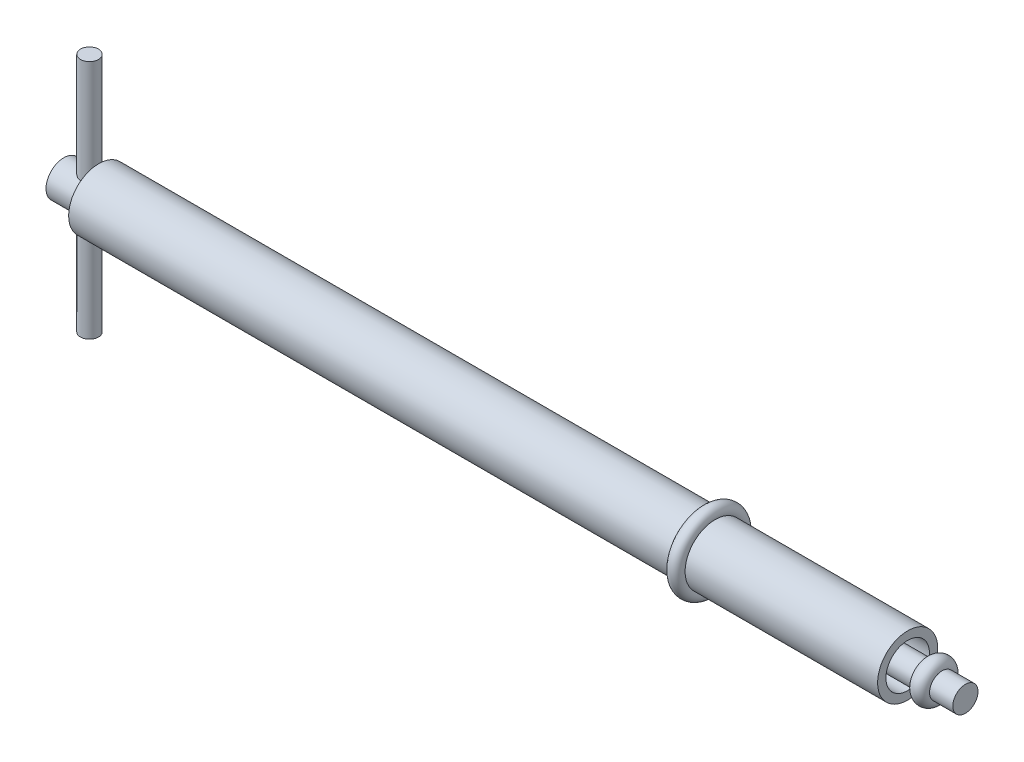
ISO-10303-21;
HEADER;
FILE_DESCRIPTION(('STEP AP214'),'2;1');
FILE_NAME('part.step','',(''),(''),'','','');
FILE_SCHEMA(('AUTOMOTIVE_DESIGN { 1 0 10303 214 1 1 1 1 }'));
ENDSEC;
DATA;
#1=APPLICATION_CONTEXT('core data for automotive mechanical design processes');
#2=APPLICATION_PROTOCOL_DEFINITION('international standard','automotive_design',2000,#1);
#3=PRODUCT_CONTEXT('',#1,'mechanical');
#4=PRODUCT('Part','Part','',(#3));
#5=PRODUCT_RELATED_PRODUCT_CATEGORY('part','',(#4));
#6=PRODUCT_DEFINITION_FORMATION('','',#4);
#7=PRODUCT_DEFINITION_CONTEXT('part definition',#1,'design');
#8=PRODUCT_DEFINITION('design','',#6,#7);
#9=PRODUCT_DEFINITION_SHAPE('','',#8);
#10=(LENGTH_UNIT() NAMED_UNIT(*) SI_UNIT(.MILLI.,.METRE.));
#11=(NAMED_UNIT(*) PLANE_ANGLE_UNIT() SI_UNIT($,.RADIAN.));
#12=(NAMED_UNIT(*) SI_UNIT($,.STERADIAN.) SOLID_ANGLE_UNIT());
#13=UNCERTAINTY_MEASURE_WITH_UNIT(LENGTH_MEASURE(1.E-05),#10,'distance_accuracy_value','');
#14=(GEOMETRIC_REPRESENTATION_CONTEXT(3) GLOBAL_UNCERTAINTY_ASSIGNED_CONTEXT((#13)) GLOBAL_UNIT_ASSIGNED_CONTEXT((#10,
#11,#12)) REPRESENTATION_CONTEXT('',''));
#15=CARTESIAN_POINT('',(0.,0.,0.));
#16=DIRECTION('',(0.,0.,1.));
#17=DIRECTION('',(1.,0.,0.));
#18=AXIS2_PLACEMENT_3D('',#15,#16,#17);
#19=CARTESIAN_POINT('',(0.,0.,0.));
#20=DIRECTION('',(1.,0.,0.));
#21=DIRECTION('',(0.,0.,-1.));
#22=AXIS2_PLACEMENT_3D('',#19,#20,#21);
#23=PLANE('',#22);
#24=CARTESIAN_POINT('',(0.,0.,0.));
#25=DIRECTION('',(-1.,0.,0.));
#26=DIRECTION('',(0.,0.,1.));
#27=AXIS2_PLACEMENT_3D('',#24,#25,#26);
#28=CIRCLE('',#27,2.96848884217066);
#29=CARTESIAN_POINT('',(0.,0.,2.96848884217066));
#30=VERTEX_POINT('',#29);
#31=EDGE_CURVE('E9',#30,#30,#28,.T.);
#32=ORIENTED_EDGE('',*,*,#31,.T.);
#33=EDGE_LOOP('',(#32));
#34=FACE_BOUND('',#33,.T.);
#35=ADVANCED_FACE('F14',(#34),#23,.F.);
#36=CARTESIAN_POINT('',(0.,0.,0.));
#37=DIRECTION('',(-1.,0.,0.));
#38=DIRECTION('',(0.,0.,1.));
#39=AXIS2_PLACEMENT_3D('',#36,#37,#38);
#40=CYLINDRICAL_SURFACE('',#39,2.96848884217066);
#41=CARTESIAN_POINT('',(4.2661907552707,-2.56162565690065,1.5));
#42=CARTESIAN_POINT('',(4.34422264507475,-2.56163267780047,1.4999944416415));
#43=CARTESIAN_POINT('',(4.42235011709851,-2.5652455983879,1.49387019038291));
#44=CARTESIAN_POINT('',(4.57619660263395,-2.57917019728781,1.46969018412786));
#45=CARTESIAN_POINT('',(4.65191032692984,-2.58949565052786,1.45160989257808));
#46=CARTESIAN_POINT('',(4.7984121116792,-2.61534051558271,1.40450365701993));
#47=CARTESIAN_POINT('',(4.86922439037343,-2.63083180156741,1.37553687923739));
#48=CARTESIAN_POINT('',(5.00496574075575,-2.66521903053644,1.3076607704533));
#49=CARTESIAN_POINT('',(5.06989438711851,-2.68411521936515,1.26875072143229));
#50=CARTESIAN_POINT('',(5.1980701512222,-2.72512943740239,1.17824574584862));
#51=CARTESIAN_POINT('',(5.26071360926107,-2.74738478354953,1.12585775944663));
#52=CARTESIAN_POINT('',(5.37679616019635,-2.79150219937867,1.01153200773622));
#53=CARTESIAN_POINT('',(5.43023057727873,-2.81336406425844,0.949589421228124));
#54=CARTESIAN_POINT('',(5.53000027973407,-2.85604040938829,0.812675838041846));
#55=CARTESIAN_POINT('',(5.57558830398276,-2.87667768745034,0.737099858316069));
#56=CARTESIAN_POINT('',(5.65312694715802,-2.91278858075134,0.57811281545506));
#57=CARTESIAN_POINT('',(5.68508635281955,-2.92826552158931,0.494706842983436));
#58=CARTESIAN_POINT('',(5.73205409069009,-2.95132082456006,0.328826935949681));
#59=CARTESIAN_POINT('',(5.74812234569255,-2.95939000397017,0.246722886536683));
#60=CARTESIAN_POINT('',(5.76634693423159,-2.96855664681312,0.0806187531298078));
#61=CARTESIAN_POINT('',(5.76851189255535,-2.96965843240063,-0.00338012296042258));
#62=CARTESIAN_POINT('',(5.75926674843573,-2.96499461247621,-0.162900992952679));
#63=CARTESIAN_POINT('',(5.74904466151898,-2.95982995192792,-0.238513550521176));
#64=CARTESIAN_POINT('',(5.71744812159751,-2.94412744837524,-0.386779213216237));
#65=CARTESIAN_POINT('',(5.69607283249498,-2.93358920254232,-0.459432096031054));
#66=CARTESIAN_POINT('',(5.64265046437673,-2.90792243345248,-0.600967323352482));
#67=CARTESIAN_POINT('',(5.6104622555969,-2.89273345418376,-0.669784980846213));
#68=CARTESIAN_POINT('',(5.53652935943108,-2.85912624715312,-0.801205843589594));
#69=CARTESIAN_POINT('',(5.49478127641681,-2.84070687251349,-0.863806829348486));
#70=CARTESIAN_POINT('',(5.39831355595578,-2.80027310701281,-0.987431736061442));
#71=CARTESIAN_POINT('',(5.34273339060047,-2.77808334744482,-1.04772730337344));
#72=CARTESIAN_POINT('',(5.22247589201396,-2.73373058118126,-1.15853905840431));
#73=CARTESIAN_POINT('',(5.15779137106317,-2.711567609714,-1.20904744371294));
#74=CARTESIAN_POINT('',(5.01595350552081,-2.66818702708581,-1.30211863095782));
#75=CARTESIAN_POINT('',(4.93825943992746,-2.64712790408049,-1.34393869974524));
#76=CARTESIAN_POINT('',(4.77563373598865,-2.61059724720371,-1.41360191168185));
#77=CARTESIAN_POINT('',(4.69070988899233,-2.59511979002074,-1.44145988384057));
#78=CARTESIAN_POINT('',(4.52314660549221,-2.5732516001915,-1.48012245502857));
#79=CARTESIAN_POINT('',(4.44086504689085,-2.5662346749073,-1.4921098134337));
#80=CARTESIAN_POINT('',(4.27518725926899,-2.56030791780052,-1.50226241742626));
#81=CARTESIAN_POINT('',(4.19179190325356,-2.56139207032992,-1.50043791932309));
#82=CARTESIAN_POINT('',(4.0363004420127,-2.57088003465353,-1.48410429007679));
#83=CARTESIAN_POINT('',(3.96399155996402,-2.57844372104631,-1.47105036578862));
#84=CARTESIAN_POINT('',(3.82273455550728,-2.5987858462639,-1.43480545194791));
#85=CARTESIAN_POINT('',(3.75378756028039,-2.61156602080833,-1.4116110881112));
#86=CARTESIAN_POINT('',(3.61758262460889,-2.64158935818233,-1.35462537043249));
#87=CARTESIAN_POINT('',(3.55054962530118,-2.65901132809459,-1.32039421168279));
#88=CARTESIAN_POINT('',(3.4227891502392,-2.69620279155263,-1.24268708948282));
#89=CARTESIAN_POINT('',(3.36206494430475,-2.71597349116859,-1.19920636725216));
#90=CARTESIAN_POINT('',(3.24042974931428,-2.75870627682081,-1.09766735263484));
#91=CARTESIAN_POINT('',(3.18050972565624,-2.78175048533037,-1.03845113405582));
#92=CARTESIAN_POINT('',(3.07113715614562,-2.82623083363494,-0.910458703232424));
#93=CARTESIAN_POINT('',(3.02168838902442,-2.84766639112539,-0.841679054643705));
#94=CARTESIAN_POINT('',(2.93345142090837,-2.88730330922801,-0.693843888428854));
#95=CARTESIAN_POINT('',(2.89500808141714,-2.90539479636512,-0.61455096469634));
#96=CARTESIAN_POINT('',(2.83239387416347,-2.93546253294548,-0.449446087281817));
#97=CARTESIAN_POINT('',(2.80821021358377,-2.94744426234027,-0.363640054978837));
#98=CARTESIAN_POINT('',(2.77692709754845,-2.96305064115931,-0.196555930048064));
#99=CARTESIAN_POINT('',(2.76844828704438,-2.96734871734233,-0.115598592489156));
#100=CARTESIAN_POINT('',(2.76472481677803,-2.96922900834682,0.046686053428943));
#101=CARTESIAN_POINT('',(2.76947531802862,-2.96681367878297,0.128013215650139));
#102=CARTESIAN_POINT('',(2.79117351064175,-2.95593044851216,0.282881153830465));
#103=CARTESIAN_POINT('',(2.80726716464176,-2.94788661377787,0.356574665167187));
#104=CARTESIAN_POINT('',(2.8500269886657,-2.92696073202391,0.500089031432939));
#105=CARTESIAN_POINT('',(2.87669464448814,-2.91407800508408,0.569909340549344));
#106=CARTESIAN_POINT('',(2.94100554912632,-2.88395591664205,0.70700699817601));
#107=CARTESIAN_POINT('',(2.97906392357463,-2.86655585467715,0.774053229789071));
#108=CARTESIAN_POINT('',(3.06455784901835,-2.82919949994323,0.901081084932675));
#109=CARTESIAN_POINT('',(3.11199768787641,-2.80924203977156,0.961059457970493));
#110=CARTESIAN_POINT('',(3.2204757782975,-2.76635443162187,1.0786621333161));
#111=CARTESIAN_POINT('',(3.28240495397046,-2.74332800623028,1.13543169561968));
#112=CARTESIAN_POINT('',(3.41521608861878,-2.69855126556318,1.23810027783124));
#113=CARTESIAN_POINT('',(3.48610617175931,-2.67680213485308,1.28398932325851));
#114=CARTESIAN_POINT('',(3.63807370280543,-2.63645767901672,1.36496837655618));
#115=CARTESIAN_POINT('',(3.71942032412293,-2.61799889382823,1.39962566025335));
#116=CARTESIAN_POINT('',(3.88798624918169,-2.5880823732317,1.45421765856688));
#117=CARTESIAN_POINT('',(3.97518486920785,-2.57660128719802,1.47420152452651));
#118=CARTESIAN_POINT('',(4.09717142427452,-2.56697512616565,1.49083314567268));
#119=CARTESIAN_POINT('',(4.13084530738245,-2.56497652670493,1.49426512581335));
#120=CARTESIAN_POINT('',(4.1984036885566,-2.56230022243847,1.49884983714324));
#121=CARTESIAN_POINT('',(4.23228820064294,-2.56162260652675,1.50000241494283));
#122=CARTESIAN_POINT('',(4.2661907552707,-2.56162565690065,1.5));
#123=B_SPLINE_CURVE_WITH_KNOTS('',3,(#41,#42,#43,#44,#45,#46,#47,#48,#49,#50,#51,#52,#53,#54,
#55,#56,#57,#58,#59,#60,#61,#62,#63,#64,#65,#66,#67,#68,#69,#70,#71,#72,#73,#74,#75,#76,#77,#78,
#79,#80,#81,#82,#83,#84,#85,#86,#87,#88,#89,#90,#91,#92,#93,#94,#95,#96,#97,#98,#99,#100,#101,
#102,#103,#104,#105,#106,#107,#108,#109,#110,#111,#112,#113,#114,#115,#116,#117,#118,#119,#120,
#121,#122),.UNSPECIFIED.,.T.,.F.,(4,2,2,2,2,2,2,2,2,2,2,2,2,2,2,2,2,2,2,2,2,2,2,2,2,2,2,2,2,2,2,
2,2,2,2,2,2,2,2,2,4),(0.,0.233952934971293,0.468387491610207,0.701565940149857,
0.934761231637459,1.18762397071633,1.44061472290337,1.71111458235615,1.98143977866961,
2.2321892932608,2.48278324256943,2.71113163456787,2.93949714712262,3.17096723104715,
3.40251966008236,3.65630154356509,3.91028491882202,4.18100181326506,4.45143056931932,
4.70029410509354,4.94897285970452,5.16957851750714,5.39025763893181,5.62112511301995,
5.85211165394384,6.11296325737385,6.37390883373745,6.64230820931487,6.91046642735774,
7.15369256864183,7.39682975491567,7.62338321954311,7.84996852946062,8.08610136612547,
8.32234237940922,8.58252752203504,8.8429502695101,9.1124607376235,9.38106425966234,
9.48270307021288,9.58434872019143),.UNSPECIFIED.);
#124=CARTESIAN_POINT('',(4.2661907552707,-2.56162565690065,1.5));
#125=VERTEX_POINT('',#124);
#126=EDGE_CURVE('E17',#125,#125,#123,.T.);
#127=ORIENTED_EDGE('',*,*,#126,.T.);
#128=EDGE_LOOP('',(#127));
#129=FACE_BOUND('',#128,.T.);
#130=CARTESIAN_POINT('',(4.2661907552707,2.56162565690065,1.5));
#131=CARTESIAN_POINT('',(4.18815886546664,2.56163267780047,1.4999944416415));
#132=CARTESIAN_POINT('',(4.11003139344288,2.5652455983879,1.49387019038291));
#133=CARTESIAN_POINT('',(3.95618490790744,2.57917019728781,1.46969018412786));
#134=CARTESIAN_POINT('',(3.88047118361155,2.58949565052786,1.45160989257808));
#135=CARTESIAN_POINT('',(3.73396939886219,2.61534051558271,1.40450365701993));
#136=CARTESIAN_POINT('',(3.66315712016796,2.63083180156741,1.37553687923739));
#137=CARTESIAN_POINT('',(3.52741576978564,2.66521903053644,1.3076607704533));
#138=CARTESIAN_POINT('',(3.46248712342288,2.68411521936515,1.26875072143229));
#139=CARTESIAN_POINT('',(3.33431135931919,2.72512943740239,1.17824574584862));
#140=CARTESIAN_POINT('',(3.27166790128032,2.74738478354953,1.12585775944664));
#141=CARTESIAN_POINT('',(3.15558535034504,2.79150219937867,1.01153200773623));
#142=CARTESIAN_POINT('',(3.10215093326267,2.81336406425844,0.949589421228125));
#143=CARTESIAN_POINT('',(3.00238123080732,2.85604040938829,0.812675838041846));
#144=CARTESIAN_POINT('',(2.95679320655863,2.87667768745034,0.73709985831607));
#145=CARTESIAN_POINT('',(2.87925456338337,2.91278858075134,0.578112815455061));
#146=CARTESIAN_POINT('',(2.84729515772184,2.92826552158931,0.494706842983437));
#147=CARTESIAN_POINT('',(2.8003274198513,2.95132082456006,0.328826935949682));
#148=CARTESIAN_POINT('',(2.78425916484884,2.95939000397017,0.246722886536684));
#149=CARTESIAN_POINT('',(2.7660345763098,2.96855664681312,0.0806187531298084));
#150=CARTESIAN_POINT('',(2.76386961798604,2.96965843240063,-0.00338012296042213));
#151=CARTESIAN_POINT('',(2.77311476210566,2.96499461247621,-0.162900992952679));
#152=CARTESIAN_POINT('',(2.78333684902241,2.95982995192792,-0.238513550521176));
#153=CARTESIAN_POINT('',(2.81493338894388,2.94412744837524,-0.386779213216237));
#154=CARTESIAN_POINT('',(2.83630867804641,2.93358920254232,-0.459432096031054));
#155=CARTESIAN_POINT('',(2.88973104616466,2.90792243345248,-0.600967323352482));
#156=CARTESIAN_POINT('',(2.92191925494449,2.89273345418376,-0.669784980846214));
#157=CARTESIAN_POINT('',(2.99585215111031,2.85912624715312,-0.801205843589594));
#158=CARTESIAN_POINT('',(3.03760023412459,2.84070687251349,-0.863806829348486));
#159=CARTESIAN_POINT('',(3.13406795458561,2.80027310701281,-0.987431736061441));
#160=CARTESIAN_POINT('',(3.18964811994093,2.77808334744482,-1.04772730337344));
#161=CARTESIAN_POINT('',(3.30990561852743,2.73373058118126,-1.15853905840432));
#162=CARTESIAN_POINT('',(3.37459013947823,2.711567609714,-1.20904744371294));
#163=CARTESIAN_POINT('',(3.51642800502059,2.66818702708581,-1.30211863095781));
#164=CARTESIAN_POINT('',(3.59412207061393,2.64712790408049,-1.34393869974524));
#165=CARTESIAN_POINT('',(3.75674777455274,2.6105972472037,-1.41360191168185));
#166=CARTESIAN_POINT('',(3.84167162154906,2.59511979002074,-1.44145988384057));
#167=CARTESIAN_POINT('',(4.00923490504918,2.5732516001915,-1.48012245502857));
#168=CARTESIAN_POINT('',(4.09151646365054,2.5662346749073,-1.4921098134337));
#169=CARTESIAN_POINT('',(4.2571942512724,2.56030791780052,-1.50226241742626));
#170=CARTESIAN_POINT('',(4.34058960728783,2.56139207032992,-1.50043791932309));
#171=CARTESIAN_POINT('',(4.49608106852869,2.57088003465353,-1.48410429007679));
#172=CARTESIAN_POINT('',(4.56838995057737,2.57844372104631,-1.47105036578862));
#173=CARTESIAN_POINT('',(4.70964695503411,2.59878584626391,-1.43480545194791));
#174=CARTESIAN_POINT('',(4.77859395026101,2.61156602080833,-1.4116110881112));
#175=CARTESIAN_POINT('',(4.9147988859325,2.64158935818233,-1.35462537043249));
#176=CARTESIAN_POINT('',(4.98183188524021,2.65901132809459,-1.32039421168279));
#177=CARTESIAN_POINT('',(5.10959236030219,2.69620279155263,-1.24268708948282));
#178=CARTESIAN_POINT('',(5.17031656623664,2.71597349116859,-1.19920636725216));
#179=CARTESIAN_POINT('',(5.29195176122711,2.75870627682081,-1.09766735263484));
#180=CARTESIAN_POINT('',(5.35187178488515,2.78175048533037,-1.03845113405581));
#181=CARTESIAN_POINT('',(5.46124435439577,2.82623083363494,-0.910458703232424));
#182=CARTESIAN_POINT('',(5.51069312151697,2.84766639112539,-0.841679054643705));
#183=CARTESIAN_POINT('',(5.59893008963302,2.88730330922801,-0.693843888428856));
#184=CARTESIAN_POINT('',(5.63737342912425,2.90539479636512,-0.614550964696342));
#185=CARTESIAN_POINT('',(5.69998763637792,2.93546253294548,-0.449446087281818));
#186=CARTESIAN_POINT('',(5.72417129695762,2.94744426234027,-0.363640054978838));
#187=CARTESIAN_POINT('',(5.75545441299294,2.96305064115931,-0.196555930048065));
#188=CARTESIAN_POINT('',(5.76393322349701,2.96734871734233,-0.115598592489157));
#189=CARTESIAN_POINT('',(5.76765669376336,2.96922900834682,0.0466860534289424));
#190=CARTESIAN_POINT('',(5.76290619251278,2.96681367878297,0.128013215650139));
#191=CARTESIAN_POINT('',(5.74120799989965,2.95593044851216,0.282881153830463));
#192=CARTESIAN_POINT('',(5.72511434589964,2.94788661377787,0.356574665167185));
#193=CARTESIAN_POINT('',(5.68235452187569,2.92696073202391,0.500089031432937));
#194=CARTESIAN_POINT('',(5.65568686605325,2.91407800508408,0.569909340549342));
#195=CARTESIAN_POINT('',(5.59137596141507,2.88395591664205,0.707006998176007));
#196=CARTESIAN_POINT('',(5.55331758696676,2.86655585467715,0.774053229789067));
#197=CARTESIAN_POINT('',(5.46782366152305,2.82919949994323,0.901081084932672));
#198=CARTESIAN_POINT('',(5.42038382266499,2.80924203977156,0.961059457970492));
#199=CARTESIAN_POINT('',(5.3119057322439,2.76635443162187,1.0786621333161));
#200=CARTESIAN_POINT('',(5.24997655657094,2.74332800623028,1.13543169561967));
#201=CARTESIAN_POINT('',(5.11716542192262,2.69855126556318,1.23810027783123));
#202=CARTESIAN_POINT('',(5.04627533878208,2.67680213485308,1.28398932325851));
#203=CARTESIAN_POINT('',(4.89430780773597,2.63645767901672,1.36496837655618));
#204=CARTESIAN_POINT('',(4.81296118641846,2.61799889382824,1.39962566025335));
#205=CARTESIAN_POINT('',(4.6443952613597,2.5880823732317,1.45421765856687));
#206=CARTESIAN_POINT('',(4.55719664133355,2.57660128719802,1.47420152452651));
#207=CARTESIAN_POINT('',(4.43521008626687,2.56697512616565,1.49083314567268));
#208=CARTESIAN_POINT('',(4.40153620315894,2.56497652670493,1.49426512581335));
#209=CARTESIAN_POINT('',(4.33397782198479,2.56230022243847,1.49884983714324));
#210=CARTESIAN_POINT('',(4.30009330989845,2.56162260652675,1.50000241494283));
#211=CARTESIAN_POINT('',(4.2661907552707,2.56162565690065,1.5));
#212=B_SPLINE_CURVE_WITH_KNOTS('',3,(#130,#131,#132,#133,#134,#135,#136,#137,#138,#139,#140,
#141,#142,#143,#144,#145,#146,#147,#148,#149,#150,#151,#152,#153,#154,#155,#156,#157,#158,#159,
#160,#161,#162,#163,#164,#165,#166,#167,#168,#169,#170,#171,#172,#173,#174,#175,#176,#177,#178,
#179,#180,#181,#182,#183,#184,#185,#186,#187,#188,#189,#190,#191,#192,#193,#194,#195,#196,#197,
#198,#199,#200,#201,#202,#203,#204,#205,#206,#207,#208,#209,#210,#211),.UNSPECIFIED.,.T.,.F.,(4,
2,2,2,2,2,2,2,2,2,2,2,2,2,2,2,2,2,2,2,2,2,2,2,2,2,2,2,2,2,2,2,2,2,2,2,2,2,2,2,4),(0.,
0.233952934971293,0.468387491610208,0.701565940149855,0.934761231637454,1.18762397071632,
1.44061472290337,1.71111458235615,1.98143977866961,2.2321892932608,2.48278324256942,
2.71113163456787,2.93949714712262,3.17096723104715,3.40251966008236,3.65630154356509,
3.91028491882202,4.18100181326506,4.45143056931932,4.70029410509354,4.94897285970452,
5.16957851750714,5.39025763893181,5.62112511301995,5.85211165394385,6.11296325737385,
6.37390883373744,6.64230820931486,6.91046642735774,7.15369256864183,7.39682975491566,
7.62338321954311,7.84996852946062,8.08610136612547,8.32234237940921,8.58252752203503,
8.8429502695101,9.1124607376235,9.38106425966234,9.48270307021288,9.58434872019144),.UNSPECIFIED.);
#213=CARTESIAN_POINT('',(4.2661907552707,2.56162565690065,1.5));
#214=VERTEX_POINT('',#213);
#215=EDGE_CURVE('E33',#214,#214,#212,.T.);
#216=ORIENTED_EDGE('',*,*,#215,.T.);
#217=EDGE_LOOP('',(#216));
#218=FACE_BOUND('',#217,.T.);
#219=ORIENTED_EDGE('',*,*,#31,.F.);
#220=EDGE_LOOP('',(#219));
#221=FACE_BOUND('',#220,.T.);
#222=CARTESIAN_POINT('',(5.7989899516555,0.,0.));
#223=DIRECTION('',(-1.,0.,0.));
#224=DIRECTION('',(0.,0.,1.));
#225=AXIS2_PLACEMENT_3D('',#222,#223,#224);
#226=CIRCLE('',#225,2.96848884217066);
#227=CARTESIAN_POINT('',(5.7989899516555,0.,2.96848884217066));
#228=VERTEX_POINT('',#227);
#229=EDGE_CURVE('E25',#228,#228,#226,.T.);
#230=ORIENTED_EDGE('',*,*,#229,.T.);
#231=EDGE_LOOP('',(#230));
#232=FACE_BOUND('',#231,.T.);
#233=ADVANCED_FACE('F39',(#129,#218,#221,#232),#40,.T.);
#234=CARTESIAN_POINT('',(5.7989899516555,2.96848884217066,0.));
#235=DIRECTION('',(1.,0.,0.));
#236=DIRECTION('',(0.,0.,-1.));
#237=AXIS2_PLACEMENT_3D('',#234,#235,#236);
#238=PLANE('',#237);
#239=ORIENTED_EDGE('',*,*,#229,.F.);
#240=EDGE_LOOP('',(#239));
#241=FACE_BOUND('',#240,.T.);
#242=CARTESIAN_POINT('',(5.7989899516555,0.,0.));
#243=DIRECTION('',(-1.,0.,0.));
#244=DIRECTION('',(0.,0.,1.));
#245=AXIS2_PLACEMENT_3D('',#242,#243,#244);
#246=CIRCLE('',#245,5.);
#247=CARTESIAN_POINT('',(5.7989899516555,0.,5.));
#248=VERTEX_POINT('',#247);
#249=EDGE_CURVE('E30',#248,#248,#246,.T.);
#250=ORIENTED_EDGE('',*,*,#249,.T.);
#251=EDGE_LOOP('',(#250));
#252=FACE_BOUND('',#251,.T.);
#253=ADVANCED_FACE('F91',(#241,#252),#238,.F.);
#254=CARTESIAN_POINT('',(0.,0.,0.));
#255=DIRECTION('',(-1.,0.,0.));
#256=DIRECTION('',(0.,0.,1.));
#257=AXIS2_PLACEMENT_3D('',#254,#255,#256);
#258=CYLINDRICAL_SURFACE('',#257,5.);
#259=ORIENTED_EDGE('',*,*,#249,.F.);
#260=EDGE_LOOP('',(#259));
#261=FACE_BOUND('',#260,.T.);
#262=CARTESIAN_POINT('',(106.327394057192,0.,0.));
#263=DIRECTION('',(-1.,0.,0.));
#264=DIRECTION('',(0.,0.,1.));
#265=AXIS2_PLACEMENT_3D('',#262,#263,#264);
#266=CIRCLE('',#265,5.);
#267=CARTESIAN_POINT('',(106.327394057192,0.,5.));
#268=VERTEX_POINT('',#267);
#269=EDGE_CURVE('E246',#268,#268,#266,.T.);
#270=ORIENTED_EDGE('',*,*,#269,.T.);
#271=EDGE_LOOP('',(#270));
#272=FACE_BOUND('',#271,.T.);
#273=ADVANCED_FACE('F88',(#261,#272),#258,.T.);
#274=CARTESIAN_POINT('',(107.344067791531,0.,0.));
#275=DIRECTION('',(-1.,0.,0.));
#276=DIRECTION('',(0.,0.,1.));
#277=AXIS2_PLACEMENT_3D('',#274,#275,#276);
#278=TOROIDAL_SURFACE('',#277,5.45662602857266,1.11451012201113);
#279=ORIENTED_EDGE('',*,*,#269,.F.);
#280=EDGE_LOOP('',(#279));
#281=FACE_BOUND('',#280,.T.);
#282=CARTESIAN_POINT('',(108.36074152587,0.,0.));
#283=DIRECTION('',(-1.,0.,0.));
#284=DIRECTION('',(0.,0.,1.));
#285=AXIS2_PLACEMENT_3D('',#282,#283,#284);
#286=CIRCLE('',#285,5.);
#287=CARTESIAN_POINT('',(108.36074152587,0.,5.));
#288=VERTEX_POINT('',#287);
#289=EDGE_CURVE('E243',#288,#288,#286,.T.);
#290=ORIENTED_EDGE('',*,*,#289,.T.);
#291=EDGE_LOOP('',(#290));
#292=FACE_BOUND('',#291,.T.);
#293=ADVANCED_FACE('F84',(#281,#292),#278,.T.);
#294=CARTESIAN_POINT('',(0.,0.,0.));
#295=DIRECTION('',(-1.,0.,0.));
#296=DIRECTION('',(0.,0.,1.));
#297=AXIS2_PLACEMENT_3D('',#294,#295,#296);
#298=CYLINDRICAL_SURFACE('',#297,5.);
#299=ORIENTED_EDGE('',*,*,#289,.F.);
#300=EDGE_LOOP('',(#299));
#301=FACE_BOUND('',#300,.T.);
#302=CARTESIAN_POINT('',(140.390499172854,0.,0.));
#303=DIRECTION('',(-1.,0.,0.));
#304=DIRECTION('',(0.,0.,1.));
#305=AXIS2_PLACEMENT_3D('',#302,#303,#304);
#306=CIRCLE('',#305,5.);
#307=CARTESIAN_POINT('',(140.390499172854,0.,5.));
#308=VERTEX_POINT('',#307);
#309=EDGE_CURVE('E240',#308,#308,#306,.T.);
#310=ORIENTED_EDGE('',*,*,#309,.T.);
#311=EDGE_LOOP('',(#310));
#312=FACE_BOUND('',#311,.T.);
#313=ADVANCED_FACE('F80',(#301,#312),#298,.T.);
#314=CARTESIAN_POINT('',(140.390499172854,5.,0.));
#315=DIRECTION('',(-1.,0.,0.));
#316=DIRECTION('',(0.,0.,1.));
#317=AXIS2_PLACEMENT_3D('',#314,#315,#316);
#318=PLANE('',#317);
#319=ORIENTED_EDGE('',*,*,#309,.F.);
#320=EDGE_LOOP('',(#319));
#321=FACE_BOUND('',#320,.T.);
#322=CARTESIAN_POINT('',(140.390499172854,0.,0.));
#323=DIRECTION('',(-1.,0.,0.));
#324=DIRECTION('',(0.,0.,1.));
#325=AXIS2_PLACEMENT_3D('',#322,#323,#324);
#326=CIRCLE('',#325,3.62012250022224);
#327=CARTESIAN_POINT('',(140.390499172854,0.,3.62012250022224));
#328=VERTEX_POINT('',#327);
#329=EDGE_CURVE('E237',#328,#328,#326,.T.);
#330=ORIENTED_EDGE('',*,*,#329,.T.);
#331=EDGE_LOOP('',(#330));
#332=FACE_BOUND('',#331,.T.);
#333=ADVANCED_FACE('F76',(#321,#332),#318,.F.);
#334=CARTESIAN_POINT('',(0.,0.,0.));
#335=DIRECTION('',(-1.,0.,0.));
#336=DIRECTION('',(0.,0.,1.));
#337=AXIS2_PLACEMENT_3D('',#334,#335,#336);
#338=CYLINDRICAL_SURFACE('',#337,3.62012250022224);
#339=ORIENTED_EDGE('',*,*,#329,.F.);
#340=EDGE_LOOP('',(#339));
#341=FACE_BOUND('',#340,.T.);
#342=CARTESIAN_POINT('',(135.391137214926,0.,0.));
#343=DIRECTION('',(-1.,0.,0.));
#344=DIRECTION('',(0.,0.,1.));
#345=AXIS2_PLACEMENT_3D('',#342,#343,#344);
#346=CIRCLE('',#345,3.62012250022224);
#347=CARTESIAN_POINT('',(135.391137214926,0.,3.62012250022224));
#348=VERTEX_POINT('',#347);
#349=EDGE_CURVE('E234',#348,#348,#346,.T.);
#350=ORIENTED_EDGE('',*,*,#349,.T.);
#351=EDGE_LOOP('',(#350));
#352=FACE_BOUND('',#351,.T.);
#353=ADVANCED_FACE('F72',(#341,#352),#338,.F.);
#354=CARTESIAN_POINT('',(135.391137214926,3.62012250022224,0.));
#355=DIRECTION('',(-1.,0.,0.));
#356=DIRECTION('',(0.,0.,1.));
#357=AXIS2_PLACEMENT_3D('',#354,#355,#356);
#358=PLANE('',#357);
#359=ORIENTED_EDGE('',*,*,#349,.F.);
#360=EDGE_LOOP('',(#359));
#361=FACE_BOUND('',#360,.T.);
#362=CARTESIAN_POINT('',(135.391137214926,0.,0.));
#363=DIRECTION('',(-1.,0.,0.));
#364=DIRECTION('',(0.,0.,1.));
#365=AXIS2_PLACEMENT_3D('',#362,#363,#364);
#366=CIRCLE('',#365,2.0959973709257);
#367=CARTESIAN_POINT('',(135.391137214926,0.,2.0959973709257));
#368=VERTEX_POINT('',#367);
#369=EDGE_CURVE('E231',#368,#368,#366,.T.);
#370=ORIENTED_EDGE('',*,*,#369,.T.);
#371=EDGE_LOOP('',(#370));
#372=FACE_BOUND('',#371,.T.);
#373=ADVANCED_FACE('F68',(#361,#372),#358,.F.);
#374=CARTESIAN_POINT('',(0.,0.,0.));
#375=DIRECTION('',(-1.,0.,0.));
#376=DIRECTION('',(0.,0.,1.));
#377=AXIS2_PLACEMENT_3D('',#374,#375,#376);
#378=CYLINDRICAL_SURFACE('',#377,2.0959973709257);
#379=ORIENTED_EDGE('',*,*,#369,.F.);
#380=EDGE_LOOP('',(#379));
#381=FACE_BOUND('',#380,.T.);
#382=CARTESIAN_POINT('',(143.390837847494,0.,0.));
#383=DIRECTION('',(-1.,0.,0.));
#384=DIRECTION('',(0.,0.,1.));
#385=AXIS2_PLACEMENT_3D('',#382,#383,#384);
#386=CIRCLE('',#385,2.0959973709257);
#387=CARTESIAN_POINT('',(143.390837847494,0.,2.0959973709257));
#388=VERTEX_POINT('',#387);
#389=EDGE_CURVE('E228',#388,#388,#386,.T.);
#390=ORIENTED_EDGE('',*,*,#389,.T.);
#391=EDGE_LOOP('',(#390));
#392=FACE_BOUND('',#391,.T.);
#393=ADVANCED_FACE('F64',(#381,#392),#378,.T.);
#394=CARTESIAN_POINT('',(144.755709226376,0.,0.));
#395=DIRECTION('',(-1.,0.,0.));
#396=DIRECTION('',(0.,0.,1.));
#397=AXIS2_PLACEMENT_3D('',#394,#395,#396);
#398=TOROIDAL_SURFACE('',#397,2.0959973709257,1.36487137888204);
#399=ORIENTED_EDGE('',*,*,#389,.F.);
#400=EDGE_LOOP('',(#399));
#401=FACE_BOUND('',#400,.T.);
#402=CARTESIAN_POINT('',(146.120580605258,0.,0.));
#403=DIRECTION('',(-1.,0.,0.));
#404=DIRECTION('',(0.,0.,1.));
#405=AXIS2_PLACEMENT_3D('',#402,#403,#404);
#406=CIRCLE('',#405,2.0959973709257);
#407=CARTESIAN_POINT('',(146.120580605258,0.,2.0959973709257));
#408=VERTEX_POINT('',#407);
#409=EDGE_CURVE('E225',#408,#408,#406,.T.);
#410=ORIENTED_EDGE('',*,*,#409,.T.);
#411=EDGE_LOOP('',(#410));
#412=FACE_BOUND('',#411,.T.);
#413=ADVANCED_FACE('F60',(#401,#412),#398,.T.);
#414=CARTESIAN_POINT('',(0.,0.,0.));
#415=DIRECTION('',(-1.,0.,0.));
#416=DIRECTION('',(0.,0.,1.));
#417=AXIS2_PLACEMENT_3D('',#414,#415,#416);
#418=CYLINDRICAL_SURFACE('',#417,2.0959973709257);
#419=ORIENTED_EDGE('',*,*,#409,.F.);
#420=EDGE_LOOP('',(#419));
#421=FACE_BOUND('',#420,.T.);
#422=CARTESIAN_POINT('',(150.,0.,0.));
#423=DIRECTION('',(-1.,0.,0.));
#424=DIRECTION('',(0.,0.,1.));
#425=AXIS2_PLACEMENT_3D('',#422,#423,#424);
#426=CIRCLE('',#425,2.0959973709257);
#427=CARTESIAN_POINT('',(150.,0.,2.0959973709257));
#428=VERTEX_POINT('',#427);
#429=EDGE_CURVE('E222',#428,#428,#426,.T.);
#430=ORIENTED_EDGE('',*,*,#429,.T.);
#431=EDGE_LOOP('',(#430));
#432=FACE_BOUND('',#431,.T.);
#433=ADVANCED_FACE('F56',(#421,#432),#418,.T.);
#434=CARTESIAN_POINT('',(150.,2.0959973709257,0.));
#435=DIRECTION('',(-1.,0.,0.));
#436=DIRECTION('',(0.,0.,1.));
#437=AXIS2_PLACEMENT_3D('',#434,#435,#436);
#438=PLANE('',#437);
#439=ORIENTED_EDGE('',*,*,#429,.F.);
#440=EDGE_LOOP('',(#439));
#441=FACE_BOUND('',#440,.T.);
#442=ADVANCED_FACE('F51',(#441),#438,.F.);
#443=CARTESIAN_POINT('',(4.2661907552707,20.,0.));
#444=DIRECTION('',(0.,1.,0.));
#445=DIRECTION('',(0.,0.,1.));
#446=AXIS2_PLACEMENT_3D('',#443,#444,#445);
#447=PLANE('',#446);
#448=CARTESIAN_POINT('',(4.2661907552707,20.,0.));
#449=DIRECTION('',(0.,1.,0.));
#450=DIRECTION('',(0.,0.,1.));
#451=AXIS2_PLACEMENT_3D('',#448,#449,#450);
#452=CIRCLE('',#451,1.5);
#453=CARTESIAN_POINT('',(4.2661907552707,20.,1.5));
#454=VERTEX_POINT('',#453);
#455=EDGE_CURVE('E217',#454,#454,#452,.T.);
#456=ORIENTED_EDGE('',*,*,#455,.T.);
#457=EDGE_LOOP('',(#456));
#458=FACE_BOUND('',#457,.T.);
#459=ADVANCED_FACE('F55',(#458),#447,.T.);
#460=CARTESIAN_POINT('',(4.2661907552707,-20.,0.));
#461=DIRECTION('',(0.,1.,0.));
#462=DIRECTION('',(0.,0.,1.));
#463=AXIS2_PLACEMENT_3D('',#460,#461,#462);
#464=CYLINDRICAL_SURFACE('',#463,1.5);
#465=ORIENTED_EDGE('',*,*,#455,.F.);
#466=EDGE_LOOP('',(#465));
#467=FACE_BOUND('',#466,.T.);
#468=ORIENTED_EDGE('',*,*,#215,.F.);
#469=EDGE_LOOP('',(#468));
#470=FACE_BOUND('',#469,.T.);
#471=ADVANCED_FACE('F48',(#467,#470),#464,.T.);
#472=CARTESIAN_POINT('',(4.2661907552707,-20.,0.));
#473=DIRECTION('',(0.,1.,0.));
#474=DIRECTION('',(0.,0.,1.));
#475=AXIS2_PLACEMENT_3D('',#472,#473,#474);
#476=CIRCLE('',#475,1.5);
#477=CARTESIAN_POINT('',(4.2661907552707,-20.,1.5));
#478=VERTEX_POINT('',#477);
#479=EDGE_CURVE('E38',#478,#478,#476,.T.);
#480=ORIENTED_EDGE('',*,*,#479,.T.);
#481=EDGE_LOOP('',(#480));
#482=FACE_BOUND('',#481,.T.);
#483=ORIENTED_EDGE('',*,*,#126,.F.);
#484=EDGE_LOOP('',(#483));
#485=FACE_BOUND('',#484,.T.);
#486=ADVANCED_FACE('F42',(#482,#485),#464,.T.);
#487=CARTESIAN_POINT('',(4.2661907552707,-20.,0.));
#488=DIRECTION('',(0.,1.,0.));
#489=DIRECTION('',(0.,0.,1.));
#490=AXIS2_PLACEMENT_3D('',#487,#488,#489);
#491=PLANE('',#490);
#492=ORIENTED_EDGE('',*,*,#479,.F.);
#493=EDGE_LOOP('',(#492));
#494=FACE_BOUND('',#493,.T.);
#495=ADVANCED_FACE('F47',(#494),#491,.F.);
#496=CLOSED_SHELL('',(#35,#233,#253,#273,#293,#313,#333,#353,#373,#393,#413,#433,#442,#459,#471,
#486,#495));
#497=MANIFOLD_SOLID_BREP('B1',#496);
#498=ADVANCED_BREP_SHAPE_REPRESENTATION('',(#18,#497),#14);
#499=SHAPE_DEFINITION_REPRESENTATION(#9,#498);
ENDSEC;
END-ISO-10303-21;
